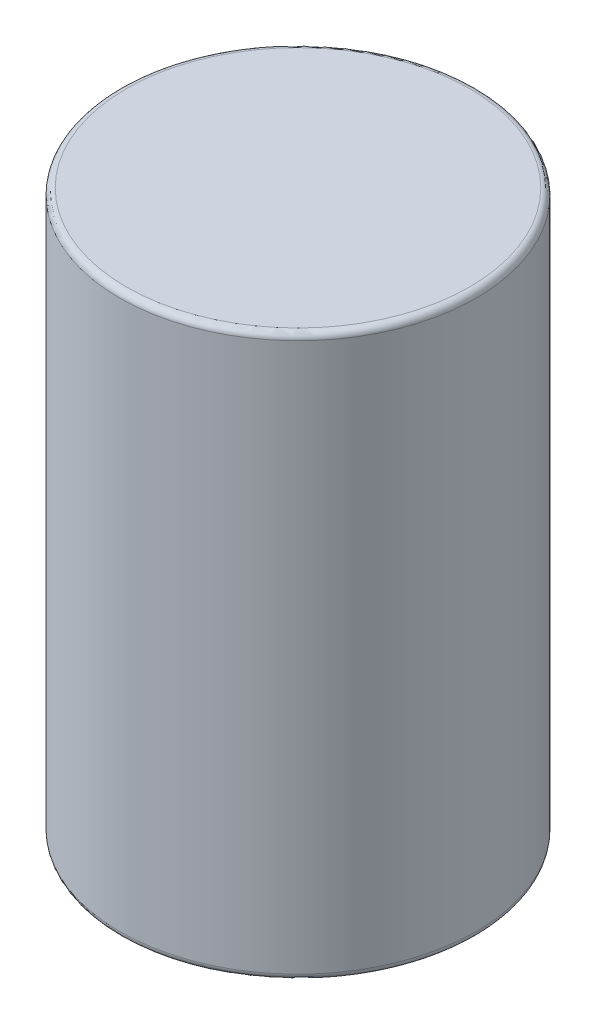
ISO-10303-21;
HEADER;
FILE_DESCRIPTION(('STEP AP214'),'2;1');
FILE_NAME('part.step','',(''),(''),'','','');
FILE_SCHEMA(('AUTOMOTIVE_DESIGN { 1 0 10303 214 1 1 1 1 }'));
ENDSEC;
DATA;
#1=APPLICATION_CONTEXT('core data for automotive mechanical design processes');
#2=APPLICATION_PROTOCOL_DEFINITION('international standard','automotive_design',2000,#1);
#3=PRODUCT_CONTEXT('',#1,'mechanical');
#4=PRODUCT('Part','Part','',(#3));
#5=PRODUCT_RELATED_PRODUCT_CATEGORY('part','',(#4));
#6=PRODUCT_DEFINITION_FORMATION('','',#4);
#7=PRODUCT_DEFINITION_CONTEXT('part definition',#1,'design');
#8=PRODUCT_DEFINITION('design','',#6,#7);
#9=PRODUCT_DEFINITION_SHAPE('','',#8);
#10=(LENGTH_UNIT() NAMED_UNIT(*) SI_UNIT(.MILLI.,.METRE.));
#11=(NAMED_UNIT(*) PLANE_ANGLE_UNIT() SI_UNIT($,.RADIAN.));
#12=(NAMED_UNIT(*) SI_UNIT($,.STERADIAN.) SOLID_ANGLE_UNIT());
#13=UNCERTAINTY_MEASURE_WITH_UNIT(LENGTH_MEASURE(1.E-05),#10,'distance_accuracy_value','');
#14=(GEOMETRIC_REPRESENTATION_CONTEXT(3) GLOBAL_UNCERTAINTY_ASSIGNED_CONTEXT((#13)) GLOBAL_UNIT_ASSIGNED_CONTEXT((#10,
#11,#12)) REPRESENTATION_CONTEXT('',''));
#15=CARTESIAN_POINT('',(0.,0.,0.));
#16=DIRECTION('',(0.,0.,1.));
#17=DIRECTION('',(1.,0.,0.));
#18=AXIS2_PLACEMENT_3D('',#15,#16,#17);
#19=CARTESIAN_POINT('',(0.,0.,0.));
#20=DIRECTION('',(0.,1.,0.));
#21=DIRECTION('',(0.,0.,1.));
#22=AXIS2_PLACEMENT_3D('',#19,#20,#21);
#23=PLANE('',#22);
#24=CARTESIAN_POINT('',(-3.75,0.,0.));
#25=DIRECTION('',(0.,1.,0.));
#26=DIRECTION('',(0.,0.,1.));
#27=AXIS2_PLACEMENT_3D('',#24,#25,#26);
#28=CIRCLE('',#27,0.375);
#29=CARTESIAN_POINT('',(-3.75,0.,0.375));
#30=VERTEX_POINT('',#29);
#31=EDGE_CURVE('E51',#30,#30,#28,.F.);
#32=ORIENTED_EDGE('',*,*,#31,.F.);
#33=EDGE_LOOP('',(#32));
#34=FACE_BOUND('',#33,.T.);
#35=CARTESIAN_POINT('',(0.,0.,0.));
#36=DIRECTION('',(0.,1.,0.));
#37=DIRECTION('',(0.,0.,1.));
#38=AXIS2_PLACEMENT_3D('',#35,#36,#37);
#39=CIRCLE('',#38,7.95);
#40=CARTESIAN_POINT('',(0.,0.,7.95));
#41=VERTEX_POINT('',#40);
#42=EDGE_CURVE('E59',#41,#41,#39,.F.);
#43=ORIENTED_EDGE('',*,*,#42,.T.);
#44=EDGE_LOOP('',(#43));
#45=FACE_BOUND('',#44,.T.);
#46=CARTESIAN_POINT('',(3.75,0.,0.));
#47=DIRECTION('',(0.,1.,0.));
#48=DIRECTION('',(0.,0.,1.));
#49=AXIS2_PLACEMENT_3D('',#46,#47,#48);
#50=CIRCLE('',#49,0.375);
#51=CARTESIAN_POINT('',(3.75,0.,0.375));
#52=VERTEX_POINT('',#51);
#53=EDGE_CURVE('E12',#52,#52,#50,.F.);
#54=ORIENTED_EDGE('',*,*,#53,.F.);
#55=EDGE_LOOP('',(#54));
#56=FACE_BOUND('',#55,.T.);
#57=ADVANCED_FACE('F44',(#34,#45,#56),#23,.F.);
#58=CARTESIAN_POINT('',(0.,26.,0.));
#59=DIRECTION('',(0.,-1.,0.));
#60=DIRECTION('',(0.,0.,-1.));
#61=AXIS2_PLACEMENT_3D('',#58,#59,#60);
#62=CYLINDRICAL_SURFACE('',#61,8.25);
#63=CARTESIAN_POINT('',(0.,0.300000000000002,0.));
#64=DIRECTION('',(0.,1.,0.));
#65=DIRECTION('',(0.,0.,1.));
#66=AXIS2_PLACEMENT_3D('',#63,#64,#65);
#67=CIRCLE('',#66,8.25);
#68=CARTESIAN_POINT('',(0.,0.300000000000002,-8.25));
#69=VERTEX_POINT('',#68);
#70=EDGE_CURVE('E64',#69,#69,#67,.T.);
#71=CARTESIAN_POINT('',(0.,25.7,0.));
#72=DIRECTION('',(0.,1.,0.));
#73=DIRECTION('',(0.,0.,1.));
#74=AXIS2_PLACEMENT_3D('',#71,#72,#73);
#75=CIRCLE('',#74,8.25);
#76=CARTESIAN_POINT('',(0.,25.7,-8.25));
#77=VERTEX_POINT('',#76);
#78=EDGE_CURVE('E67',#77,#77,#75,.F.);
#79=CARTESIAN_POINT('',(0.,0.300000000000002,-8.25));
#80=CARTESIAN_POINT('',(0.,0.564583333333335,-8.25));
#81=CARTESIAN_POINT('',(0.,0.829166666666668,-8.25));
#82=CARTESIAN_POINT('',(0.,1.35833333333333,-8.25));
#83=CARTESIAN_POINT('',(0.,1.62291666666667,-8.25));
#84=CARTESIAN_POINT('',(0.,2.15208333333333,-8.25));
#85=CARTESIAN_POINT('',(0.,2.41666666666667,-8.25));
#86=CARTESIAN_POINT('',(0.,2.94583333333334,-8.25));
#87=CARTESIAN_POINT('',(0.,3.21041666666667,-8.25));
#88=CARTESIAN_POINT('',(0.,3.73958333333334,-8.25));
#89=CARTESIAN_POINT('',(0.,4.00416666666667,-8.25));
#90=CARTESIAN_POINT('',(0.,4.53333333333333,-8.25));
#91=CARTESIAN_POINT('',(0.,4.79791666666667,-8.25));
#92=CARTESIAN_POINT('',(0.,5.32708333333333,-8.25));
#93=CARTESIAN_POINT('',(0.,5.59166666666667,-8.25));
#94=CARTESIAN_POINT('',(0.,6.12083333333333,-8.25));
#95=CARTESIAN_POINT('',(0.,6.38541666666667,-8.25));
#96=CARTESIAN_POINT('',(0.,6.91458333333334,-8.25));
#97=CARTESIAN_POINT('',(0.,7.17916666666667,-8.25));
#98=CARTESIAN_POINT('',(0.,7.70833333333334,-8.25));
#99=CARTESIAN_POINT('',(0.,7.97291666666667,-8.25));
#100=CARTESIAN_POINT('',(0.,8.50208333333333,-8.25));
#101=CARTESIAN_POINT('',(0.,8.76666666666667,-8.25));
#102=CARTESIAN_POINT('',(0.,9.29583333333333,-8.25));
#103=CARTESIAN_POINT('',(0.,9.56041666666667,-8.25));
#104=CARTESIAN_POINT('',(0.,10.0895833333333,-8.25));
#105=CARTESIAN_POINT('',(0.,10.3541666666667,-8.25));
#106=CARTESIAN_POINT('',(0.,10.8833333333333,-8.25));
#107=CARTESIAN_POINT('',(0.,11.1479166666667,-8.25));
#108=CARTESIAN_POINT('',(0.,11.6770833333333,-8.25));
#109=CARTESIAN_POINT('',(0.,11.9416666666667,-8.25));
#110=CARTESIAN_POINT('',(0.,12.4708333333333,-8.25));
#111=CARTESIAN_POINT('',(0.,12.7354166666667,-8.25));
#112=CARTESIAN_POINT('',(0.,13.2645833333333,-8.25));
#113=CARTESIAN_POINT('',(0.,13.5291666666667,-8.25));
#114=CARTESIAN_POINT('',(0.,14.0583333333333,-8.25));
#115=CARTESIAN_POINT('',(0.,14.3229166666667,-8.25));
#116=CARTESIAN_POINT('',(0.,14.8520833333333,-8.25));
#117=CARTESIAN_POINT('',(0.,15.1166666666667,-8.25));
#118=CARTESIAN_POINT('',(0.,15.6458333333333,-8.25));
#119=CARTESIAN_POINT('',(0.,15.9104166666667,-8.25));
#120=CARTESIAN_POINT('',(0.,16.4395833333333,-8.25));
#121=CARTESIAN_POINT('',(0.,16.7041666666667,-8.25));
#122=CARTESIAN_POINT('',(0.,17.2333333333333,-8.25));
#123=CARTESIAN_POINT('',(0.,17.4979166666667,-8.25));
#124=CARTESIAN_POINT('',(0.,18.0270833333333,-8.25));
#125=CARTESIAN_POINT('',(0.,18.2916666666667,-8.25));
#126=CARTESIAN_POINT('',(0.,18.8208333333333,-8.25));
#127=CARTESIAN_POINT('',(0.,19.0854166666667,-8.25));
#128=CARTESIAN_POINT('',(0.,19.6145833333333,-8.25));
#129=CARTESIAN_POINT('',(0.,19.8791666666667,-8.25));
#130=CARTESIAN_POINT('',(0.,20.4083333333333,-8.25));
#131=CARTESIAN_POINT('',(0.,20.6729166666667,-8.25));
#132=CARTESIAN_POINT('',(0.,21.2020833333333,-8.25));
#133=CARTESIAN_POINT('',(0.,21.4666666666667,-8.25));
#134=CARTESIAN_POINT('',(0.,21.9958333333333,-8.25));
#135=CARTESIAN_POINT('',(0.,22.2604166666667,-8.25));
#136=CARTESIAN_POINT('',(0.,22.7895833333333,-8.25));
#137=CARTESIAN_POINT('',(0.,23.0541666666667,-8.25));
#138=CARTESIAN_POINT('',(0.,23.5833333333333,-8.25));
#139=CARTESIAN_POINT('',(0.,23.8479166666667,-8.25));
#140=CARTESIAN_POINT('',(0.,24.3770833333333,-8.25));
#141=CARTESIAN_POINT('',(0.,24.6416666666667,-8.25));
#142=CARTESIAN_POINT('',(0.,25.1708333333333,-8.25));
#143=CARTESIAN_POINT('',(0.,25.4354166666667,-8.25));
#144=CARTESIAN_POINT('',(0.,25.7,-8.25));
#145=B_SPLINE_CURVE_WITH_KNOTS('',3,(#79,#80,#81,#82,#83,#84,#85,#86,#87,#88,#89,#90,#91,#92,
#93,#94,#95,#96,#97,#98,#99,#100,#101,#102,#103,#104,#105,#106,#107,#108,#109,#110,#111,#112,
#113,#114,#115,#116,#117,#118,#119,#120,#121,#122,#123,#124,#125,#126,#127,#128,#129,#130,#131,
#132,#133,#134,#135,#136,#137,#138,#139,#140,#141,#142,#143,#144),.UNSPECIFIED.,.F.,.F.,(4,2,2,
2,2,2,2,2,2,2,2,2,2,2,2,2,2,2,2,2,2,2,2,2,2,2,2,2,2,2,2,2,4),(0.,0.793749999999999,1.5875,
2.38125,3.175,3.96875,4.7625,5.55625,6.35,7.14375,7.9375,8.73125,9.525,10.31875,11.1125,
11.90625,12.7,13.49375,14.2875,15.08125,15.875,16.66875,17.4625,18.25625,19.05,19.84375,20.6375,
21.43125,22.225,23.01875,23.8125,24.60625,25.4),.UNSPECIFIED.);
#146=EDGE_CURVE('BSEAM92',#69,#77,#145,.T.);
#147=ORIENTED_EDGE('',*,*,#70,.T.);
#148=ORIENTED_EDGE('',*,*,#78,.T.);
#149=ORIENTED_EDGE('',*,*,#146,.T.);
#150=ORIENTED_EDGE('',*,*,#146,.F.);
#151=EDGE_LOOP('',(#147,#149,#148,#150));
#152=FACE_BOUND('',#151,.T.);
#153=ADVANCED_FACE('F92',(#152),#62,.T.);
#154=CARTESIAN_POINT('',(0.,26.,0.));
#155=DIRECTION('',(0.,1.,0.));
#156=DIRECTION('',(0.,0.,1.));
#157=AXIS2_PLACEMENT_3D('',#154,#155,#156);
#158=PLANE('',#157);
#159=CARTESIAN_POINT('',(0.,26.,0.));
#160=DIRECTION('',(0.,1.,0.));
#161=DIRECTION('',(0.,0.,1.));
#162=AXIS2_PLACEMENT_3D('',#159,#160,#161);
#163=CIRCLE('',#162,7.95);
#164=CARTESIAN_POINT('',(0.,26.,7.95));
#165=VERTEX_POINT('',#164);
#166=EDGE_CURVE('E55',#165,#165,#163,.T.);
#167=ORIENTED_EDGE('',*,*,#166,.T.);
#168=EDGE_LOOP('',(#167));
#169=FACE_BOUND('',#168,.T.);
#170=ADVANCED_FACE('F98',(#169),#158,.T.);
#171=CARTESIAN_POINT('',(0.,0.300000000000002,0.));
#172=DIRECTION('',(0.,1.,0.));
#173=DIRECTION('',(0.,0.,1.));
#174=AXIS2_PLACEMENT_3D('',#171,#172,#173);
#175=TOROIDAL_SURFACE('',#174,7.95,0.3);
#176=ORIENTED_EDGE('',*,*,#42,.F.);
#177=EDGE_LOOP('',(#176));
#178=FACE_BOUND('',#177,.T.);
#179=ORIENTED_EDGE('',*,*,#70,.F.);
#180=EDGE_LOOP('',(#179));
#181=FACE_BOUND('',#180,.T.);
#182=ADVANCED_FACE('F104',(#178,#181),#175,.T.);
#183=CARTESIAN_POINT('',(0.,25.7,0.));
#184=DIRECTION('',(0.,1.,0.));
#185=DIRECTION('',(0.,0.,1.));
#186=AXIS2_PLACEMENT_3D('',#183,#184,#185);
#187=TOROIDAL_SURFACE('',#186,7.95,0.3);
#188=ORIENTED_EDGE('',*,*,#78,.F.);
#189=EDGE_LOOP('',(#188));
#190=FACE_BOUND('',#189,.T.);
#191=ORIENTED_EDGE('',*,*,#166,.F.);
#192=EDGE_LOOP('',(#191));
#193=FACE_BOUND('',#192,.T.);
#194=ADVANCED_FACE('F46',(#190,#193),#187,.T.);
#195=CARTESIAN_POINT('',(-3.75,-3.,0.));
#196=DIRECTION('',(0.,1.,0.));
#197=DIRECTION('',(0.,0.,1.));
#198=AXIS2_PLACEMENT_3D('',#195,#196,#197);
#199=CYLINDRICAL_SURFACE('',#198,0.375);
#200=CARTESIAN_POINT('',(-3.75,-3.,0.));
#201=DIRECTION('',(0.,-1.,0.));
#202=DIRECTION('',(0.,0.,-1.));
#203=AXIS2_PLACEMENT_3D('',#200,#201,#202);
#204=CIRCLE('',#203,0.375);
#205=CARTESIAN_POINT('',(-3.75,-3.,-0.375));
#206=VERTEX_POINT('',#205);
#207=EDGE_CURVE('E70',#206,#206,#204,.T.);
#208=ORIENTED_EDGE('',*,*,#207,.F.);
#209=EDGE_LOOP('',(#208));
#210=FACE_BOUND('',#209,.T.);
#211=ORIENTED_EDGE('',*,*,#31,.T.);
#212=EDGE_LOOP('',(#211));
#213=FACE_BOUND('',#212,.T.);
#214=ADVANCED_FACE('F88',(#210,#213),#199,.T.);
#215=CARTESIAN_POINT('',(-3.75,-3.,0.));
#216=DIRECTION('',(0.,-1.,0.));
#217=DIRECTION('',(0.,0.,-1.));
#218=AXIS2_PLACEMENT_3D('',#215,#216,#217);
#219=PLANE('',#218);
#220=ORIENTED_EDGE('',*,*,#207,.T.);
#221=EDGE_LOOP('',(#220));
#222=FACE_BOUND('',#221,.T.);
#223=ADVANCED_FACE('F81',(#222),#219,.T.);
#224=CARTESIAN_POINT('',(3.75,-3.,0.));
#225=DIRECTION('',(0.,1.,0.));
#226=DIRECTION('',(0.,0.,1.));
#227=AXIS2_PLACEMENT_3D('',#224,#225,#226);
#228=CYLINDRICAL_SURFACE('',#227,0.375);
#229=CARTESIAN_POINT('',(3.75,-3.,0.));
#230=DIRECTION('',(0.,-1.,0.));
#231=DIRECTION('',(0.,0.,1.));
#232=AXIS2_PLACEMENT_3D('',#229,#230,#231);
#233=CIRCLE('',#232,0.375);
#234=CARTESIAN_POINT('',(3.75,-3.,0.375));
#235=VERTEX_POINT('',#234);
#236=EDGE_CURVE('E73',#235,#235,#233,.T.);
#237=ORIENTED_EDGE('',*,*,#236,.F.);
#238=EDGE_LOOP('',(#237));
#239=FACE_BOUND('',#238,.T.);
#240=ORIENTED_EDGE('',*,*,#53,.T.);
#241=EDGE_LOOP('',(#240));
#242=FACE_BOUND('',#241,.T.);
#243=ADVANCED_FACE('F79',(#239,#242),#228,.T.);
#244=CARTESIAN_POINT('',(3.75,-3.,0.));
#245=DIRECTION('',(0.,1.,0.));
#246=DIRECTION('',(0.,0.,1.));
#247=AXIS2_PLACEMENT_3D('',#244,#245,#246);
#248=PLANE('',#247);
#249=ORIENTED_EDGE('',*,*,#236,.T.);
#250=EDGE_LOOP('',(#249));
#251=FACE_BOUND('',#250,.T.);
#252=ADVANCED_FACE('F77',(#251),#248,.F.);
#253=CLOSED_SHELL('',(#57,#153,#170,#182,#194,#214,#223,#243,#252));
#254=MANIFOLD_SOLID_BREP('B2',#253);
#255=ADVANCED_BREP_SHAPE_REPRESENTATION('',(#18,#254),#14);
#256=SHAPE_DEFINITION_REPRESENTATION(#9,#255);
ENDSEC;
END-ISO-10303-21;
